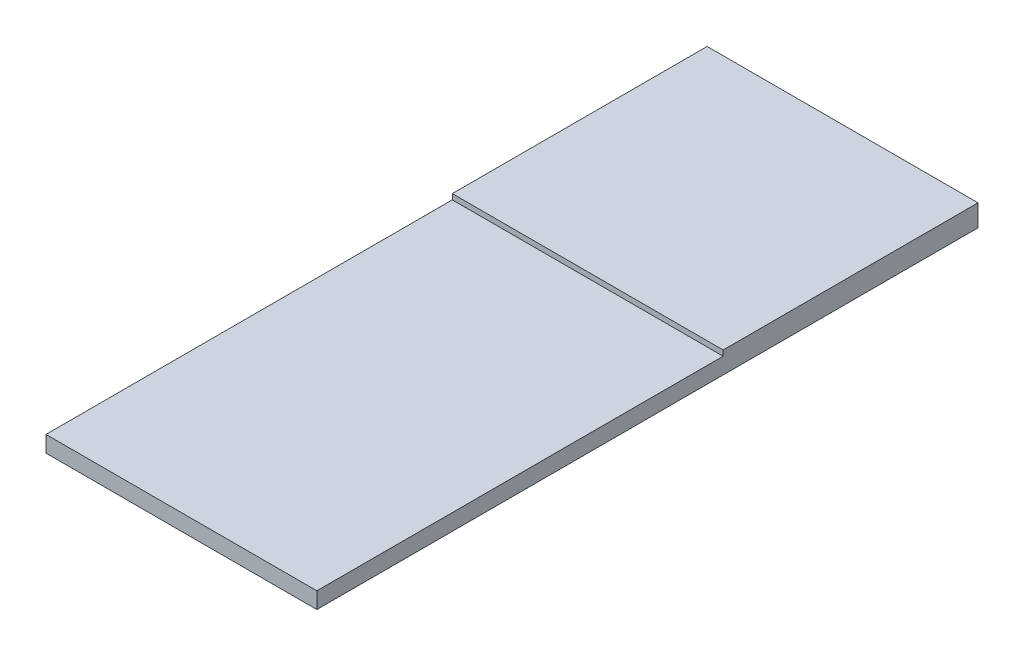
from build123d import *

# Parameters (mm, degrees)
SKETCH1_W               = 12.7
SKETCH1_H               = 31
BOSS_EXTRUDE1_DEPTH     = 1.016
CUT_EXTRUDE1_DEPTH      = 34.516
CUT_EXTRUDE1_DEPTH_BACK = 0.254
SKETCH2_W               = 12.7
SKETCH2_H               = 19.05


with BuildPart() as part:
    # Sketch1 → Boss-Extrude1 (new body)
    with BuildSketch(Plane(origin=(0, 0, 0), x_dir=(1, 0, 0), z_dir=(0, 1, 0))):
        with Locations((6.35, 15.5)):
            Rectangle(SKETCH1_W, SKETCH1_H)
    extrude(amount=BOSS_EXTRUDE1_DEPTH)

    # Sketch2 → Cut-Extrude1 (cut, two sides: drawn at the far end of the back side and taken through both)
    with BuildSketch(Plane(origin=(0, 1.016, 0), x_dir=(1, 0, 0), z_dir=(0, 1, 0)).offset(-CUT_EXTRUDE1_DEPTH_BACK)):
        with Locations((6.35, 9.525)):
            Rectangle(SKETCH2_W, SKETCH2_H)
    extrude(amount=CUT_EXTRUDE1_DEPTH + CUT_EXTRUDE1_DEPTH_BACK, mode=Mode.SUBTRACT)


solid = part.part
